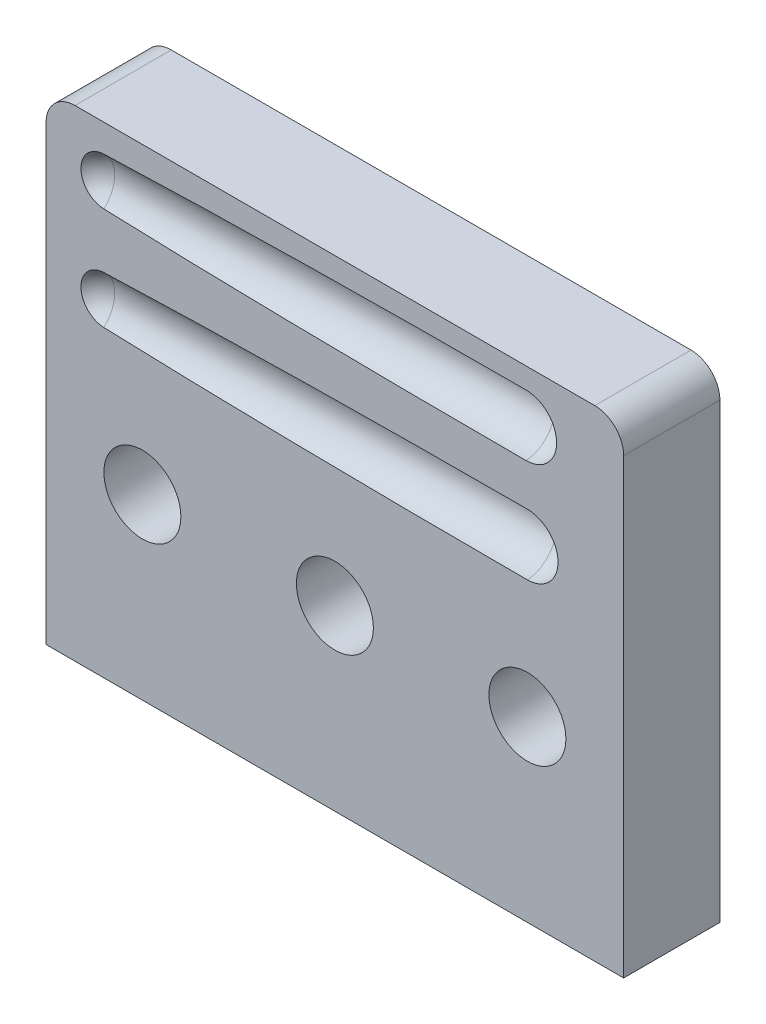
ISO-10303-21;
HEADER;
FILE_DESCRIPTION(('STEP AP214'),'2;1');
FILE_NAME('part.step','',(''),(''),'','','');
FILE_SCHEMA(('AUTOMOTIVE_DESIGN { 1 0 10303 214 1 1 1 1 }'));
ENDSEC;
DATA;
#1=APPLICATION_CONTEXT('core data for automotive mechanical design processes');
#2=APPLICATION_PROTOCOL_DEFINITION('international standard','automotive_design',2000,#1);
#3=PRODUCT_CONTEXT('',#1,'mechanical');
#4=PRODUCT('Part','Part','',(#3));
#5=PRODUCT_RELATED_PRODUCT_CATEGORY('part','',(#4));
#6=PRODUCT_DEFINITION_FORMATION('','',#4);
#7=PRODUCT_DEFINITION_CONTEXT('part definition',#1,'design');
#8=PRODUCT_DEFINITION('design','',#6,#7);
#9=PRODUCT_DEFINITION_SHAPE('','',#8);
#10=(LENGTH_UNIT() NAMED_UNIT(*) SI_UNIT(.MILLI.,.METRE.));
#11=(NAMED_UNIT(*) PLANE_ANGLE_UNIT() SI_UNIT($,.RADIAN.));
#12=(NAMED_UNIT(*) SI_UNIT($,.STERADIAN.) SOLID_ANGLE_UNIT());
#13=UNCERTAINTY_MEASURE_WITH_UNIT(LENGTH_MEASURE(1.E-05),#10,'distance_accuracy_value','');
#14=(GEOMETRIC_REPRESENTATION_CONTEXT(3) GLOBAL_UNCERTAINTY_ASSIGNED_CONTEXT((#13)) GLOBAL_UNIT_ASSIGNED_CONTEXT((#10,
#11,#12)) REPRESENTATION_CONTEXT('',''));
#15=CARTESIAN_POINT('',(0.,0.,0.));
#16=DIRECTION('',(0.,0.,1.));
#17=DIRECTION('',(1.,0.,0.));
#18=AXIS2_PLACEMENT_3D('',#15,#16,#17);
#19=CARTESIAN_POINT('',(-30.,-18.5,10.));
#20=DIRECTION('',(0.,0.,-1.));
#21=DIRECTION('',(-1.,0.,0.));
#22=AXIS2_PLACEMENT_3D('',#19,#20,#21);
#23=PLANE('',#22);
#24=CARTESIAN_POINT('',(-23.9094567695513,15.5,10.));
#25=DIRECTION('',(0.,0.,-1.));
#26=DIRECTION('',(-1.,0.,0.));
#27=AXIS2_PLACEMENT_3D('',#24,#25,#26);
#28=CIRCLE('',#27,2.47723554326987);
#29=CARTESIAN_POINT('',(-24.,17.9755803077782,10.));
#30=VERTEX_POINT('',#29);
#31=CARTESIAN_POINT('',(-24.,13.0244196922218,10.));
#32=VERTEX_POINT('',#31);
#33=EDGE_CURVE('E35',#30,#32,#28,.F.);
#34=ORIENTED_EDGE('',*,*,#33,.F.);
#35=CARTESIAN_POINT('',(20.,15.5,10.));
#36=DIRECTION('',(0.,0.,-1.));
#37=DIRECTION('',(-1.,0.,0.));
#38=AXIS2_PLACEMENT_3D('',#35,#36,#37);
#39=ELLIPSE('',#38,70.1012021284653,3.18);
#40=CARTESIAN_POINT('',(20.,18.68,10.));
#41=VERTEX_POINT('',#40);
#42=EDGE_CURVE('E11',#30,#41,#39,.T.);
#43=ORIENTED_EDGE('',*,*,#42,.T.);
#44=CARTESIAN_POINT('',(20.,15.5,10.));
#45=DIRECTION('',(0.,0.,-1.));
#46=DIRECTION('',(-1.,0.,0.));
#47=AXIS2_PLACEMENT_3D('',#44,#45,#46);
#48=CIRCLE('',#47,3.18000000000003);
#49=CARTESIAN_POINT('',(20.,12.32,10.));
#50=VERTEX_POINT('',#49);
#51=EDGE_CURVE('E110',#41,#50,#48,.T.);
#52=ORIENTED_EDGE('',*,*,#51,.T.);
#53=EDGE_CURVE('E41',#50,#32,#39,.T.);
#54=ORIENTED_EDGE('',*,*,#53,.T.);
#55=EDGE_LOOP('',(#34,#43,#52,#54));
#56=FACE_BOUND('',#55,.T.);
#57=DIRECTION('',(-1.,0.,0.));
#58=VECTOR('',#57,1.);
#59=CARTESIAN_POINT('',(30.,31.5,10.));
#60=LINE('',#59,#58);
#61=CARTESIAN_POINT('',(27.,31.5,10.));
#62=VERTEX_POINT('',#61);
#63=CARTESIAN_POINT('',(-27.,31.5,10.));
#64=VERTEX_POINT('',#63);
#65=EDGE_CURVE('E160',#62,#64,#60,.T.);
#66=ORIENTED_EDGE('',*,*,#65,.T.);
#67=CARTESIAN_POINT('',(-27.,28.5,10.));
#68=DIRECTION('',(0.,0.,-1.));
#69=DIRECTION('',(-1.,0.,0.));
#70=AXIS2_PLACEMENT_3D('',#67,#68,#69);
#71=CIRCLE('',#70,3.);
#72=CARTESIAN_POINT('',(-30.,28.5,10.));
#73=VERTEX_POINT('',#72);
#74=EDGE_CURVE('E187',#64,#73,#71,.F.);
#75=ORIENTED_EDGE('',*,*,#74,.T.);
#76=DIRECTION('',(0.,1.,0.));
#77=VECTOR('',#76,1.);
#78=CARTESIAN_POINT('',(-30.,-18.5,10.));
#79=LINE('',#78,#77);
#80=CARTESIAN_POINT('',(-30.,-18.5,10.));
#81=VERTEX_POINT('',#80);
#82=EDGE_CURVE('E157',#81,#73,#79,.T.);
#83=ORIENTED_EDGE('',*,*,#82,.F.);
#84=DIRECTION('',(1.,0.,0.));
#85=VECTOR('',#84,1.);
#86=CARTESIAN_POINT('',(-30.,-18.5,10.));
#87=LINE('',#86,#85);
#88=CARTESIAN_POINT('',(30.,-18.5,10.));
#89=VERTEX_POINT('',#88);
#90=EDGE_CURVE('E165',#81,#89,#87,.T.);
#91=ORIENTED_EDGE('',*,*,#90,.T.);
#92=DIRECTION('',(0.,-1.,0.));
#93=VECTOR('',#92,1.);
#94=CARTESIAN_POINT('',(30.,31.5,10.));
#95=LINE('',#94,#93);
#96=CARTESIAN_POINT('',(30.,28.5,10.));
#97=VERTEX_POINT('',#96);
#98=EDGE_CURVE('E163',#97,#89,#95,.T.);
#99=ORIENTED_EDGE('',*,*,#98,.F.);
#100=CARTESIAN_POINT('',(27.,28.5,10.));
#101=DIRECTION('',(0.,0.,-1.));
#102=DIRECTION('',(-1.,0.,0.));
#103=AXIS2_PLACEMENT_3D('',#100,#101,#102);
#104=CIRCLE('',#103,3.);
#105=EDGE_CURVE('E185',#97,#62,#104,.F.);
#106=ORIENTED_EDGE('',*,*,#105,.T.);
#107=EDGE_LOOP('',(#66,#75,#83,#91,#99,#106));
#108=FACE_BOUND('',#107,.T.);
#109=CARTESIAN_POINT('',(-20.,0.,10.));
#110=DIRECTION('',(0.,0.,1.));
#111=DIRECTION('',(1.,0.,0.));
#112=AXIS2_PLACEMENT_3D('',#109,#110,#111);
#113=CIRCLE('',#112,4.);
#114=CARTESIAN_POINT('',(-16.,0.,10.));
#115=VERTEX_POINT('',#114);
#116=EDGE_CURVE('E140',#115,#115,#113,.T.);
#117=ORIENTED_EDGE('',*,*,#116,.F.);
#118=EDGE_LOOP('',(#117));
#119=FACE_BOUND('',#118,.T.);
#120=CARTESIAN_POINT('',(0.,0.,10.));
#121=DIRECTION('',(0.,0.,1.));
#122=DIRECTION('',(1.,0.,0.));
#123=AXIS2_PLACEMENT_3D('',#120,#121,#122);
#124=CIRCLE('',#123,4.);
#125=CARTESIAN_POINT('',(4.,0.,10.));
#126=VERTEX_POINT('',#125);
#127=EDGE_CURVE('E134',#126,#126,#124,.T.);
#128=ORIENTED_EDGE('',*,*,#127,.F.);
#129=EDGE_LOOP('',(#128));
#130=FACE_BOUND('',#129,.T.);
#131=CARTESIAN_POINT('',(20.,0.,10.));
#132=DIRECTION('',(0.,0.,1.));
#133=DIRECTION('',(1.,0.,0.));
#134=AXIS2_PLACEMENT_3D('',#131,#132,#133);
#135=CIRCLE('',#134,4.);
#136=CARTESIAN_POINT('',(24.,0.,10.));
#137=VERTEX_POINT('',#136);
#138=EDGE_CURVE('E128',#137,#137,#135,.T.);
#139=ORIENTED_EDGE('',*,*,#138,.F.);
#140=EDGE_LOOP('',(#139));
#141=FACE_BOUND('',#140,.T.);
#142=CARTESIAN_POINT('',(-23.9094567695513,26.1607408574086,10.));
#143=DIRECTION('',(0.,0.,-1.));
#144=DIRECTION('',(-1.,0.,0.));
#145=AXIS2_PLACEMENT_3D('',#142,#143,#144);
#146=CIRCLE('',#145,2.47081382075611);
#147=CARTESIAN_POINT('',(-24.,28.6298951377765,10.));
#148=VERTEX_POINT('',#147);
#149=CARTESIAN_POINT('',(-24.,23.6915865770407,10.));
#150=VERTEX_POINT('',#149);
#151=EDGE_CURVE('E198',#148,#150,#146,.F.);
#152=ORIENTED_EDGE('',*,*,#151,.F.);
#153=CARTESIAN_POINT('',(20.,26.1607408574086,10.));
#154=DIRECTION('',(0.,0.,-1.));
#155=DIRECTION('',(-1.,0.,0.));
#156=AXIS2_PLACEMENT_3D('',#153,#154,#155);
#157=ELLIPSE('',#156,69.9909801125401,3.175);
#158=CARTESIAN_POINT('',(19.8611442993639,29.3357346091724,10.));
#159=VERTEX_POINT('',#158);
#160=EDGE_CURVE('E197',#148,#159,#157,.T.);
#161=ORIENTED_EDGE('',*,*,#160,.T.);
#162=CARTESIAN_POINT('',(19.8614300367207,26.1607408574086,10.));
#163=DIRECTION('',(0.,0.,-1.));
#164=DIRECTION('',(-1.,0.,0.));
#165=AXIS2_PLACEMENT_3D('',#162,#163,#164);
#166=CIRCLE('',#165,3.17499376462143);
#167=CARTESIAN_POINT('',(19.8611442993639,22.9857471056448,10.));
#168=VERTEX_POINT('',#167);
#169=EDGE_CURVE('E191',#159,#168,#166,.T.);
#170=ORIENTED_EDGE('',*,*,#169,.T.);
#171=EDGE_CURVE('E194',#168,#150,#157,.T.);
#172=ORIENTED_EDGE('',*,*,#171,.T.);
#173=EDGE_LOOP('',(#152,#161,#170,#172));
#174=FACE_BOUND('',#173,.T.);
#175=ADVANCED_FACE('F31',(#56,#108,#119,#130,#141,#174),#23,.F.);
#176=CARTESIAN_POINT('',(-30.,-18.5,10.));
#177=DIRECTION('',(-1.,0.,0.));
#178=DIRECTION('',(0.,0.,1.));
#179=AXIS2_PLACEMENT_3D('',#176,#177,#178);
#180=PLANE('',#179);
#181=ORIENTED_EDGE('',*,*,#82,.T.);
#182=DIRECTION('',(0.,0.,-1.));
#183=VECTOR('',#182,1.);
#184=CARTESIAN_POINT('',(-30.,28.5,10.));
#185=LINE('',#184,#183);
#186=CARTESIAN_POINT('',(-30.,28.5,0.));
#187=VERTEX_POINT('',#186);
#188=EDGE_CURVE('E173',#73,#187,#185,.T.);
#189=ORIENTED_EDGE('',*,*,#188,.T.);
#190=DIRECTION('',(0.,1.,0.));
#191=VECTOR('',#190,1.);
#192=CARTESIAN_POINT('',(-30.,-18.5,0.));
#193=LINE('',#192,#191);
#194=CARTESIAN_POINT('',(-30.,-18.5,0.));
#195=VERTEX_POINT('',#194);
#196=EDGE_CURVE('E146',#195,#187,#193,.T.);
#197=ORIENTED_EDGE('',*,*,#196,.F.);
#198=DIRECTION('',(0.,0.,-1.));
#199=VECTOR('',#198,1.);
#200=CARTESIAN_POINT('',(-30.,-18.5,10.));
#201=LINE('',#200,#199);
#202=EDGE_CURVE('E171',#81,#195,#201,.T.);
#203=ORIENTED_EDGE('',*,*,#202,.F.);
#204=EDGE_LOOP('',(#181,#189,#197,#203));
#205=FACE_BOUND('',#204,.T.);
#206=ADVANCED_FACE('F220',(#205),#180,.T.);
#207=CARTESIAN_POINT('',(-30.,-18.5,10.));
#208=DIRECTION('',(0.,1.,0.));
#209=DIRECTION('',(0.,0.,1.));
#210=AXIS2_PLACEMENT_3D('',#207,#208,#209);
#211=PLANE('',#210);
#212=DIRECTION('',(0.,0.,-1.));
#213=VECTOR('',#212,1.);
#214=CARTESIAN_POINT('',(30.,-18.5,10.));
#215=LINE('',#214,#213);
#216=CARTESIAN_POINT('',(30.,-18.5,0.));
#217=VERTEX_POINT('',#216);
#218=EDGE_CURVE('E168',#89,#217,#215,.T.);
#219=ORIENTED_EDGE('',*,*,#218,.F.);
#220=ORIENTED_EDGE('',*,*,#90,.F.);
#221=ORIENTED_EDGE('',*,*,#202,.T.);
#222=DIRECTION('',(1.,0.,0.));
#223=VECTOR('',#222,1.);
#224=CARTESIAN_POINT('',(-30.,-18.5,0.));
#225=LINE('',#224,#223);
#226=EDGE_CURVE('E154',#195,#217,#225,.T.);
#227=ORIENTED_EDGE('',*,*,#226,.T.);
#228=EDGE_LOOP('',(#219,#220,#221,#227));
#229=FACE_BOUND('',#228,.T.);
#230=ADVANCED_FACE('F33',(#229),#211,.F.);
#231=CARTESIAN_POINT('',(30.,31.5,10.));
#232=DIRECTION('',(1.,0.,0.));
#233=DIRECTION('',(0.,0.,-1.));
#234=AXIS2_PLACEMENT_3D('',#231,#232,#233);
#235=PLANE('',#234);
#236=DIRECTION('',(0.,-1.,0.));
#237=VECTOR('',#236,1.);
#238=CARTESIAN_POINT('',(30.,31.5,0.));
#239=LINE('',#238,#237);
#240=CARTESIAN_POINT('',(30.,28.5,0.));
#241=VERTEX_POINT('',#240);
#242=EDGE_CURVE('E152',#241,#217,#239,.T.);
#243=ORIENTED_EDGE('',*,*,#242,.F.);
#244=DIRECTION('',(0.,0.,-1.));
#245=VECTOR('',#244,1.);
#246=CARTESIAN_POINT('',(30.,28.5,10.));
#247=LINE('',#246,#245);
#248=EDGE_CURVE('E189',#241,#97,#247,.F.);
#249=ORIENTED_EDGE('',*,*,#248,.T.);
#250=ORIENTED_EDGE('',*,*,#98,.T.);
#251=ORIENTED_EDGE('',*,*,#218,.T.);
#252=EDGE_LOOP('',(#243,#249,#250,#251));
#253=FACE_BOUND('',#252,.T.);
#254=ADVANCED_FACE('F233',(#253),#235,.T.);
#255=CARTESIAN_POINT('',(30.,31.5,10.));
#256=DIRECTION('',(0.,-1.,0.));
#257=DIRECTION('',(1.,0.,0.));
#258=AXIS2_PLACEMENT_3D('',#255,#256,#257);
#259=PLANE('',#258);
#260=DIRECTION('',(-1.,0.,0.));
#261=VECTOR('',#260,1.);
#262=CARTESIAN_POINT('',(30.,31.5,0.));
#263=LINE('',#262,#261);
#264=CARTESIAN_POINT('',(27.,31.5,0.));
#265=VERTEX_POINT('',#264);
#266=CARTESIAN_POINT('',(-27.,31.5,0.));
#267=VERTEX_POINT('',#266);
#268=EDGE_CURVE('E149',#265,#267,#263,.T.);
#269=ORIENTED_EDGE('',*,*,#268,.T.);
#270=DIRECTION('',(0.,0.,-1.));
#271=VECTOR('',#270,1.);
#272=CARTESIAN_POINT('',(-27.,31.5,10.));
#273=LINE('',#272,#271);
#274=EDGE_CURVE('E183',#267,#64,#273,.F.);
#275=ORIENTED_EDGE('',*,*,#274,.T.);
#276=ORIENTED_EDGE('',*,*,#65,.F.);
#277=DIRECTION('',(0.,0.,-1.));
#278=VECTOR('',#277,1.);
#279=CARTESIAN_POINT('',(27.,31.5,10.));
#280=LINE('',#279,#278);
#281=EDGE_CURVE('E180',#62,#265,#280,.T.);
#282=ORIENTED_EDGE('',*,*,#281,.T.);
#283=EDGE_LOOP('',(#269,#275,#276,#282));
#284=FACE_BOUND('',#283,.T.);
#285=ADVANCED_FACE('F231',(#284),#259,.F.);
#286=CARTESIAN_POINT('',(-30.,-18.5,0.));
#287=DIRECTION('',(0.,0.,-1.));
#288=DIRECTION('',(-1.,0.,0.));
#289=AXIS2_PLACEMENT_3D('',#286,#287,#288);
#290=PLANE('',#289);
#291=CARTESIAN_POINT('',(20.,0.,0.));
#292=DIRECTION('',(0.,0.,1.));
#293=DIRECTION('',(1.,0.,0.));
#294=AXIS2_PLACEMENT_3D('',#291,#292,#293);
#295=CIRCLE('',#294,4.);
#296=CARTESIAN_POINT('',(24.,0.,0.));
#297=VERTEX_POINT('',#296);
#298=EDGE_CURVE('E131',#297,#297,#295,.T.);
#299=ORIENTED_EDGE('',*,*,#298,.T.);
#300=EDGE_LOOP('',(#299));
#301=FACE_BOUND('',#300,.T.);
#302=CARTESIAN_POINT('',(0.,0.,0.));
#303=DIRECTION('',(0.,0.,1.));
#304=DIRECTION('',(1.,0.,0.));
#305=AXIS2_PLACEMENT_3D('',#302,#303,#304);
#306=CIRCLE('',#305,4.);
#307=CARTESIAN_POINT('',(4.,0.,0.));
#308=VERTEX_POINT('',#307);
#309=EDGE_CURVE('E137',#308,#308,#306,.T.);
#310=ORIENTED_EDGE('',*,*,#309,.T.);
#311=EDGE_LOOP('',(#310));
#312=FACE_BOUND('',#311,.T.);
#313=CARTESIAN_POINT('',(-20.,0.,0.));
#314=DIRECTION('',(0.,0.,1.));
#315=DIRECTION('',(1.,0.,0.));
#316=AXIS2_PLACEMENT_3D('',#313,#314,#315);
#317=CIRCLE('',#316,4.);
#318=CARTESIAN_POINT('',(-16.,0.,0.));
#319=VERTEX_POINT('',#318);
#320=EDGE_CURVE('E143',#319,#319,#317,.T.);
#321=ORIENTED_EDGE('',*,*,#320,.T.);
#322=EDGE_LOOP('',(#321));
#323=FACE_BOUND('',#322,.T.);
#324=ORIENTED_EDGE('',*,*,#196,.T.);
#325=CARTESIAN_POINT('',(-27.,28.5,0.));
#326=DIRECTION('',(0.,0.,-1.));
#327=DIRECTION('',(-1.,0.,0.));
#328=AXIS2_PLACEMENT_3D('',#325,#326,#327);
#329=CIRCLE('',#328,3.);
#330=EDGE_CURVE('E178',#187,#267,#329,.T.);
#331=ORIENTED_EDGE('',*,*,#330,.T.);
#332=ORIENTED_EDGE('',*,*,#268,.F.);
#333=CARTESIAN_POINT('',(27.,28.5,0.));
#334=DIRECTION('',(0.,0.,-1.));
#335=DIRECTION('',(-1.,0.,0.));
#336=AXIS2_PLACEMENT_3D('',#333,#334,#335);
#337=CIRCLE('',#336,3.);
#338=EDGE_CURVE('E176',#265,#241,#337,.T.);
#339=ORIENTED_EDGE('',*,*,#338,.T.);
#340=ORIENTED_EDGE('',*,*,#242,.T.);
#341=ORIENTED_EDGE('',*,*,#226,.F.);
#342=EDGE_LOOP('',(#324,#331,#332,#339,#340,#341));
#343=FACE_BOUND('',#342,.T.);
#344=ADVANCED_FACE('F228',(#301,#312,#323,#343),#290,.T.);
#345=CARTESIAN_POINT('',(-27.,28.5,10.));
#346=DIRECTION('',(0.,0.,1.));
#347=DIRECTION('',(1.,0.,0.));
#348=AXIS2_PLACEMENT_3D('',#345,#346,#347);
#349=CYLINDRICAL_SURFACE('',#348,3.);
#350=ORIENTED_EDGE('',*,*,#74,.F.);
#351=ORIENTED_EDGE('',*,*,#274,.F.);
#352=ORIENTED_EDGE('',*,*,#330,.F.);
#353=ORIENTED_EDGE('',*,*,#188,.F.);
#354=EDGE_LOOP('',(#350,#351,#352,#353));
#355=FACE_BOUND('',#354,.T.);
#356=ADVANCED_FACE('F257',(#355),#349,.T.);
#357=CARTESIAN_POINT('',(27.,28.5,10.));
#358=DIRECTION('',(0.,0.,1.));
#359=DIRECTION('',(1.,0.,0.));
#360=AXIS2_PLACEMENT_3D('',#357,#358,#359);
#361=CYLINDRICAL_SURFACE('',#360,3.);
#362=ORIENTED_EDGE('',*,*,#105,.F.);
#363=ORIENTED_EDGE('',*,*,#248,.F.);
#364=ORIENTED_EDGE('',*,*,#338,.F.);
#365=ORIENTED_EDGE('',*,*,#281,.F.);
#366=EDGE_LOOP('',(#362,#363,#364,#365));
#367=FACE_BOUND('',#366,.T.);
#368=ADVANCED_FACE('F249',(#367),#361,.T.);
#369=CARTESIAN_POINT('',(-20.,0.,0.));
#370=DIRECTION('',(0.,0.,1.));
#371=DIRECTION('',(1.,0.,0.));
#372=AXIS2_PLACEMENT_3D('',#369,#370,#371);
#373=CYLINDRICAL_SURFACE('',#372,4.);
#374=ORIENTED_EDGE('',*,*,#320,.F.);
#375=EDGE_LOOP('',(#374));
#376=FACE_BOUND('',#375,.T.);
#377=ORIENTED_EDGE('',*,*,#116,.T.);
#378=EDGE_LOOP('',(#377));
#379=FACE_BOUND('',#378,.T.);
#380=ADVANCED_FACE('F273',(#376,#379),#373,.F.);
#381=CARTESIAN_POINT('',(0.,0.,0.));
#382=DIRECTION('',(0.,0.,1.));
#383=DIRECTION('',(1.,0.,0.));
#384=AXIS2_PLACEMENT_3D('',#381,#382,#383);
#385=CYLINDRICAL_SURFACE('',#384,4.);
#386=ORIENTED_EDGE('',*,*,#309,.F.);
#387=EDGE_LOOP('',(#386));
#388=FACE_BOUND('',#387,.T.);
#389=ORIENTED_EDGE('',*,*,#127,.T.);
#390=EDGE_LOOP('',(#389));
#391=FACE_BOUND('',#390,.T.);
#392=ADVANCED_FACE('F216',(#388,#391),#385,.F.);
#393=CARTESIAN_POINT('',(20.,0.,0.));
#394=DIRECTION('',(0.,0.,1.));
#395=DIRECTION('',(1.,0.,0.));
#396=AXIS2_PLACEMENT_3D('',#393,#394,#395);
#397=CYLINDRICAL_SURFACE('',#396,4.);
#398=ORIENTED_EDGE('',*,*,#298,.F.);
#399=EDGE_LOOP('',(#398));
#400=FACE_BOUND('',#399,.T.);
#401=ORIENTED_EDGE('',*,*,#138,.T.);
#402=EDGE_LOOP('',(#401));
#403=FACE_BOUND('',#402,.T.);
#404=ADVANCED_FACE('F208',(#400,#403),#397,.F.);
#405=CARTESIAN_POINT('',(-23.9094567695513,26.1607408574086,11.9939167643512));
#406=DIRECTION('',(-0.998970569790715,0.,0.0453629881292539));
#407=DIRECTION('',(0.,1.,0.));
#408=AXIS2_PLACEMENT_3D('',#405,#406,#407);
#409=SPHERICAL_SURFACE('',#408,3.17500000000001);
#410=ORIENTED_EDGE('',*,*,#151,.T.);
#411=CARTESIAN_POINT('',(-23.9094567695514,26.1607408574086,11.9939167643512));
#412=DIRECTION('',(-0.998970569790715,0.,0.0453629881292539));
#413=DIRECTION('',(0.0453629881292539,0.,0.998970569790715));
#414=AXIS2_PLACEMENT_3D('',#411,#412,#413);
#415=CIRCLE('',#414,3.175);
#416=EDGE_CURVE('E125',#148,#150,#415,.T.);
#417=ORIENTED_EDGE('',*,*,#416,.F.);
#418=EDGE_LOOP('',(#410,#417));
#419=FACE_BOUND('',#418,.T.);
#420=ADVANCED_FACE('F206',(#419),#409,.F.);
#421=CARTESIAN_POINT('',(-32.4717098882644,26.1607408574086,12.382726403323));
#422=DIRECTION('',(-0.998970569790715,0.,0.0453629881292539));
#423=DIRECTION('',(0.0453629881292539,0.,0.998970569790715));
#424=AXIS2_PLACEMENT_3D('',#421,#422,#423);
#425=CYLINDRICAL_SURFACE('',#424,3.175);
#426=ORIENTED_EDGE('',*,*,#416,.T.);
#427=ORIENTED_EDGE('',*,*,#171,.F.);
#428=CARTESIAN_POINT('',(19.8614300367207,26.1607408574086,10.0062924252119));
#429=DIRECTION('',(-0.998970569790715,0.,0.0453629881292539));
#430=DIRECTION('',(0.0453629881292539,0.,0.998970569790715));
#431=AXIS2_PLACEMENT_3D('',#428,#429,#430);
#432=CIRCLE('',#431,3.175);
#433=EDGE_CURVE('E55',#159,#168,#432,.T.);
#434=ORIENTED_EDGE('',*,*,#433,.F.);
#435=ORIENTED_EDGE('',*,*,#160,.F.);
#436=EDGE_LOOP('',(#426,#427,#434,#435));
#437=FACE_BOUND('',#436,.T.);
#438=ADVANCED_FACE('F205',(#437),#425,.F.);
#439=CARTESIAN_POINT('',(19.8614300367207,26.1607408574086,10.0062924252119));
#440=DIRECTION('',(-0.998970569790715,0.,0.0453629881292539));
#441=DIRECTION('',(0.,1.,0.));
#442=AXIS2_PLACEMENT_3D('',#439,#440,#441);
#443=SPHERICAL_SURFACE('',#442,3.175);
#444=ORIENTED_EDGE('',*,*,#433,.T.);
#445=ORIENTED_EDGE('',*,*,#169,.F.);
#446=EDGE_LOOP('',(#444,#445));
#447=FACE_BOUND('',#446,.T.);
#448=ADVANCED_FACE('F214',(#447),#443,.F.);
#449=CARTESIAN_POINT('',(-23.9094567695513,15.5,11.9939167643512));
#450=DIRECTION('',(-0.998970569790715,0.,0.0453629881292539));
#451=DIRECTION('',(0.,-1.,0.));
#452=AXIS2_PLACEMENT_3D('',#449,#450,#451);
#453=SPHERICAL_SURFACE('',#452,3.18000000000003);
#454=ORIENTED_EDGE('',*,*,#33,.T.);
#455=CARTESIAN_POINT('',(-23.9094567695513,15.5,11.9939167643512));
#456=DIRECTION('',(-0.998970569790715,0.,0.0453629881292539));
#457=DIRECTION('',(0.0453629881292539,0.,0.998970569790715));
#458=AXIS2_PLACEMENT_3D('',#455,#456,#457);
#459=CIRCLE('',#458,3.18);
#460=EDGE_CURVE('E48',#30,#32,#459,.T.);
#461=ORIENTED_EDGE('',*,*,#460,.F.);
#462=EDGE_LOOP('',(#454,#461));
#463=FACE_BOUND('',#462,.T.);
#464=ADVANCED_FACE('F121',(#463),#453,.F.);
#465=CARTESIAN_POINT('',(20.,15.5,10.));
#466=DIRECTION('',(-0.998970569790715,0.,0.0453629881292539));
#467=DIRECTION('',(0.,-1.,0.));
#468=AXIS2_PLACEMENT_3D('',#465,#466,#467);
#469=SPHERICAL_SURFACE('',#468,3.18000000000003);
#470=CARTESIAN_POINT('',(20.,15.5,10.));
#471=DIRECTION('',(-0.998970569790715,0.,0.0453629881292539));
#472=DIRECTION('',(0.0453629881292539,0.,0.998970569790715));
#473=AXIS2_PLACEMENT_3D('',#470,#471,#472);
#474=CIRCLE('',#473,3.18);
#475=EDGE_CURVE('E113',#41,#50,#474,.T.);
#476=ORIENTED_EDGE('',*,*,#475,.T.);
#477=ORIENTED_EDGE('',*,*,#51,.F.);
#478=EDGE_LOOP('',(#476,#477));
#479=FACE_BOUND('',#478,.T.);
#480=ADVANCED_FACE('F112',(#479),#469,.F.);
#481=CARTESIAN_POINT('',(-33.4706804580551,15.5,12.4280893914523));
#482=DIRECTION('',(-0.998970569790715,0.,0.0453629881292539));
#483=DIRECTION('',(0.0453629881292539,0.,0.998970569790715));
#484=AXIS2_PLACEMENT_3D('',#481,#482,#483);
#485=CYLINDRICAL_SURFACE('',#484,3.18);
#486=ORIENTED_EDGE('',*,*,#460,.T.);
#487=ORIENTED_EDGE('',*,*,#53,.F.);
#488=ORIENTED_EDGE('',*,*,#475,.F.);
#489=ORIENTED_EDGE('',*,*,#42,.F.);
#490=EDGE_LOOP('',(#486,#487,#488,#489));
#491=FACE_BOUND('',#490,.T.);
#492=ADVANCED_FACE('F116',(#491),#485,.F.);
#493=CLOSED_SHELL('',(#175,#206,#230,#254,#285,#344,#356,#368,#380,#392,#404,#420,#438,#448,
#464,#480,#492));
#494=MANIFOLD_SOLID_BREP('B2',#493);
#495=ADVANCED_BREP_SHAPE_REPRESENTATION('',(#18,#494),#14);
#496=SHAPE_DEFINITION_REPRESENTATION(#9,#495);
ENDSEC;
END-ISO-10303-21;
